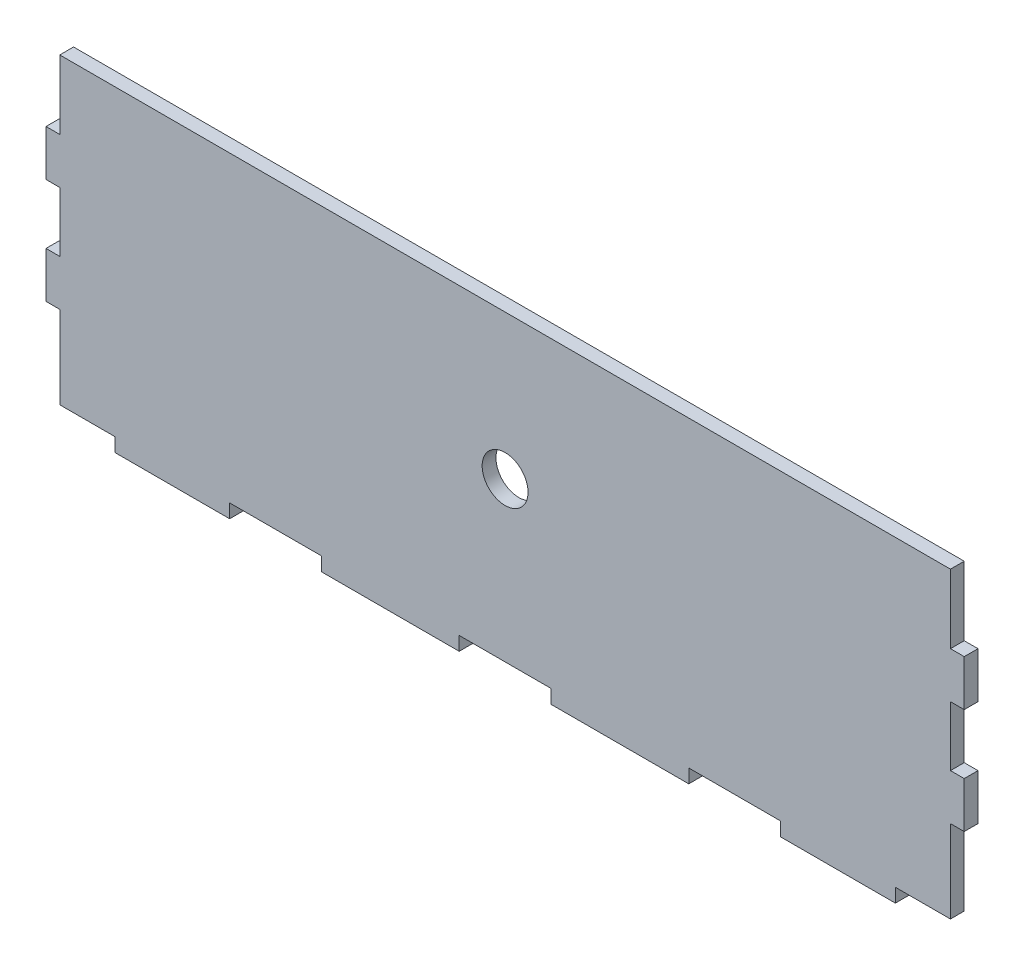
from build123d import *

# Parameters (mm, degrees)
CROQUIS1_W              = 200
CROQUIS1_H              = 75
SALIENTE_EXTRUIR1_DEPTH = 3
CROQUIS2_R              = 5
CROQUIS2_W              = 20
CROQUIS2_H              = 3
CROQUIS2_W_2            = 3
CROQUIS2_H_2            = 13
CORTAR_EXTRUIR1_DEPTH   = 6


with BuildPart() as part:
    # Croquis1 → Saliente-Extruir1 (new body)
    with BuildSketch(Plane.XY):
        with Locations((100, 37.5)):
            Rectangle(CROQUIS1_W, CROQUIS1_H)
    extrude(amount=SALIENTE_EXTRUIR1_DEPTH)

    # Croquis2 → Cortar-Extruir1 (cut)
    with BuildSketch(Plane.XY.offset(3)):
        with Locations((100, 37.5)):
            Circle(CROQUIS2_R)
        Polygon((0, 75), (15, 75), (185, 75), (200, 75), (200, 54), (197, 54), (197, 69), (3, 69), (3, 54), (0, 54), align=None)
        Polygon((3, 3), (3, 21), (0, 21), (0, 0), (15, 0), (15, 3), align=None)
        Polygon((185, 3), (197, 3), (197, 21), (200, 21), (200, 0), (185, 0), align=None)
        with Locations((150, 1.5)):
            Rectangle(CROQUIS2_W, CROQUIS2_H)
        with Locations((100, 1.5)):
            Rectangle(CROQUIS2_W, CROQUIS2_H)
        with Locations((50, 1.5)):
            Rectangle(CROQUIS2_W, CROQUIS2_H)
        with Locations((1.5, 37.5)):
            Rectangle(CROQUIS2_W_2, CROQUIS2_H_2)
        with Locations((198.5, 37.5)):
            Rectangle(CROQUIS2_W_2, CROQUIS2_H_2)
    extrude(amount=-CORTAR_EXTRUIR1_DEPTH, mode=Mode.SUBTRACT)


solid = part.part
